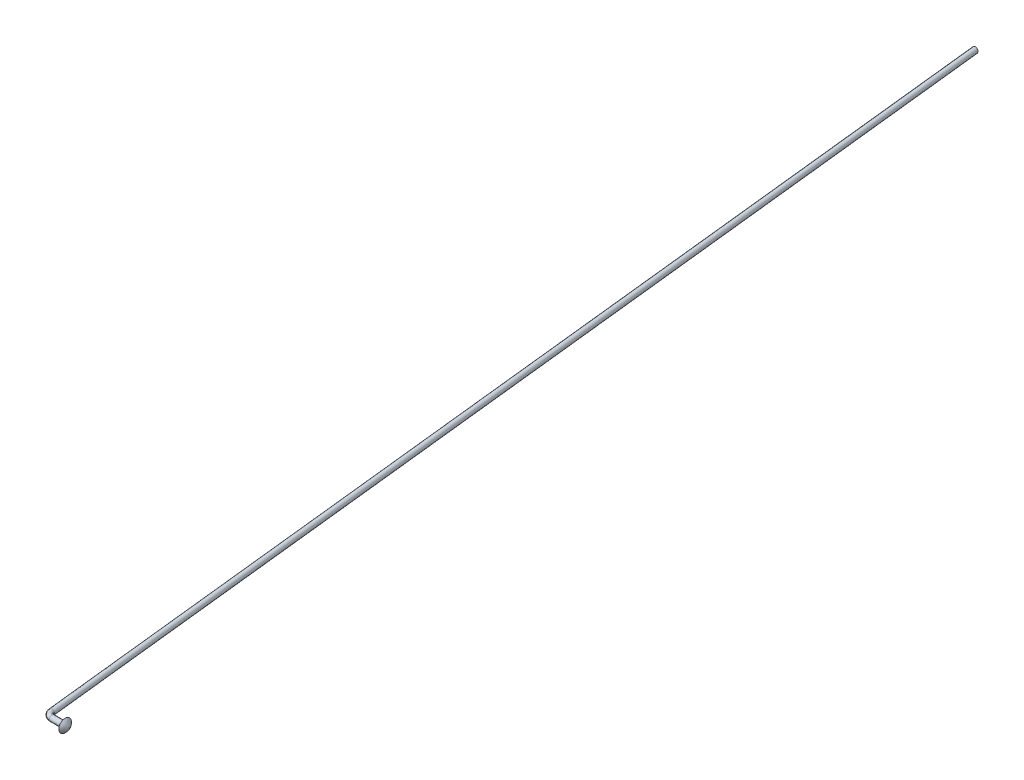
ISO-10303-21;
HEADER;
FILE_DESCRIPTION(('STEP AP214'),'2;1');
FILE_NAME('part.step','',(''),(''),'','','');
FILE_SCHEMA(('AUTOMOTIVE_DESIGN { 1 0 10303 214 1 1 1 1 }'));
ENDSEC;
DATA;
#1=APPLICATION_CONTEXT('core data for automotive mechanical design processes');
#2=APPLICATION_PROTOCOL_DEFINITION('international standard','automotive_design',2000,#1);
#3=PRODUCT_CONTEXT('',#1,'mechanical');
#4=PRODUCT('Part','Part','',(#3));
#5=PRODUCT_RELATED_PRODUCT_CATEGORY('part','',(#4));
#6=PRODUCT_DEFINITION_FORMATION('','',#4);
#7=PRODUCT_DEFINITION_CONTEXT('part definition',#1,'design');
#8=PRODUCT_DEFINITION('design','',#6,#7);
#9=PRODUCT_DEFINITION_SHAPE('','',#8);
#10=(LENGTH_UNIT() NAMED_UNIT(*) SI_UNIT(.MILLI.,.METRE.));
#11=(NAMED_UNIT(*) PLANE_ANGLE_UNIT() SI_UNIT($,.RADIAN.));
#12=(NAMED_UNIT(*) SI_UNIT($,.STERADIAN.) SOLID_ANGLE_UNIT());
#13=UNCERTAINTY_MEASURE_WITH_UNIT(LENGTH_MEASURE(1.E-05),#10,'distance_accuracy_value','');
#14=(GEOMETRIC_REPRESENTATION_CONTEXT(3) GLOBAL_UNCERTAINTY_ASSIGNED_CONTEXT((#13)) GLOBAL_UNIT_ASSIGNED_CONTEXT((#10,
#11,#12)) REPRESENTATION_CONTEXT('',''));
#15=CARTESIAN_POINT('',(0.,0.,0.));
#16=DIRECTION('',(0.,0.,1.));
#17=DIRECTION('',(1.,0.,0.));
#18=AXIS2_PLACEMENT_3D('',#15,#16,#17);
#19=CARTESIAN_POINT('',(0.758258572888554,6.66133814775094E-13,279.329081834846));
#20=DIRECTION('',(0.994746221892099,0.,0.102371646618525));
#21=DIRECTION('',(0.102371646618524,0.,-0.994746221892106));
#22=AXIS2_PLACEMENT_3D('',#19,#20,#21);
#23=CIRCLE('',#22,0.750000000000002);
#24=DIRECTION('',(0.999999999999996,0.,0.));
#25=VECTOR('',#24,1.);
#26=SURFACE_OF_LINEAR_EXTRUSION('',#23,#25);
#27=CARTESIAN_POINT('',(0.835037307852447,6.65426047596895E-13,278.583022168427));
#28=VERTEX_POINT('',#27);
#29=EDGE_CURVE('E73',#28,#28,#23,.T.);
#30=ORIENTED_EDGE('',*,*,#29,.T.);
#31=EDGE_LOOP('',(#30));
#32=FACE_BOUND('',#31,.T.);
#33=CARTESIAN_POINT('',(4.22781762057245,1.11022302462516E-12,279.329081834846));
#34=DIRECTION('',(0.994746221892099,0.,0.102371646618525));
#35=DIRECTION('',(0.102371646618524,0.,-0.994746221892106));
#36=AXIS2_PLACEMENT_3D('',#33,#34,#35);
#37=CIRCLE('',#36,0.750000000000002);
#38=CARTESIAN_POINT('',(4.22781762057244,0.75000000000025,279.329081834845));
#39=VERTEX_POINT('',#38);
#40=CARTESIAN_POINT('',(4.22781762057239,-0.750000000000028,279.329081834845));
#41=VERTEX_POINT('',#40);
#42=EDGE_CURVE('E39',#39,#41,#37,.T.);
#43=ORIENTED_EDGE('',*,*,#42,.F.);
#44=CARTESIAN_POINT('',(4.22781762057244,0.75000000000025,279.329081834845));
#45=CARTESIAN_POINT('',(4.2278176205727,0.750034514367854,279.287890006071));
#46=CARTESIAN_POINT('',(4.22781762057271,0.746572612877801,279.246709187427));
#47=CARTESIAN_POINT('',(4.2278176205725,0.732907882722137,279.165493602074));
#48=CARTESIAN_POINT('',(4.22781762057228,0.722707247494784,279.125458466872));
#49=CARTESIAN_POINT('',(4.22781762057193,0.695816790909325,279.047630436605));
#50=CARTESIAN_POINT('',(4.22781762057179,0.679127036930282,279.009837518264));
#51=CARTESIAN_POINT('',(4.22781762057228,0.639740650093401,278.937525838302));
#52=CARTESIAN_POINT('',(4.2278176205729,0.61704410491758,278.903007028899));
#53=CARTESIAN_POINT('',(4.22781762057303,0.566276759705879,278.838179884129));
#54=CARTESIAN_POINT('',(4.22781762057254,0.538206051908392,278.807871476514));
#55=CARTESIAN_POINT('',(4.22781762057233,0.47746913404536,278.752278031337));
#56=CARTESIAN_POINT('',(4.2278176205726,0.444803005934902,278.72699290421));
#57=CARTESIAN_POINT('',(4.22781762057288,0.375770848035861,278.682117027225));
#58=CARTESIAN_POINT('',(4.2278176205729,0.33940487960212,278.662526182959));
#59=CARTESIAN_POINT('',(4.2278176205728,0.263960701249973,278.629553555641));
#60=CARTESIAN_POINT('',(4.22781762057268,0.224882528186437,278.616171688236));
#61=CARTESIAN_POINT('',(4.22781762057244,0.145066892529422,278.59596575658));
#62=CARTESIAN_POINT('',(4.22781762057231,0.104329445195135,278.589141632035));
#63=CARTESIAN_POINT('',(4.22781762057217,0.0222873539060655,278.582228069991));
#64=CARTESIAN_POINT('',(4.22781762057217,-0.0190172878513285,278.582138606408));
#65=CARTESIAN_POINT('',(4.22781762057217,-0.101088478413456,278.588696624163));
#66=CARTESIAN_POINT('',(4.22781762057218,-0.1418550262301,278.59534411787));
#67=CARTESIAN_POINT('',(4.22781762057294,-0.22175729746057,278.615203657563));
#68=CARTESIAN_POINT('',(4.22781762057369,-0.260893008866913,278.628415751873));
#69=CARTESIAN_POINT('',(4.22781762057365,-0.336479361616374,278.66106016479));
#70=CARTESIAN_POINT('',(4.22781762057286,-0.372929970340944,278.680492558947));
#71=CARTESIAN_POINT('',(4.22781762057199,-0.442156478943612,278.725067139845));
#72=CARTESIAN_POINT('',(4.22781762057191,-0.474932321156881,278.750209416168));
#73=CARTESIAN_POINT('',(4.22781762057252,-0.535911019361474,278.805536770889));
#74=CARTESIAN_POINT('',(4.22781762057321,-0.564113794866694,278.835721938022));
#75=CARTESIAN_POINT('',(4.22781762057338,-0.615164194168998,278.900325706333));
#76=CARTESIAN_POINT('',(4.22781762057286,-0.638011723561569,278.934744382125));
#77=CARTESIAN_POINT('',(4.22781762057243,-0.67771503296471,279.006882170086));
#78=CARTESIAN_POINT('',(4.22781762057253,-0.694570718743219,279.044601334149));
#79=CARTESIAN_POINT('',(4.22781762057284,-0.72178829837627,279.122267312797));
#80=CARTESIAN_POINT('',(4.22781762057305,-0.732157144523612,279.162211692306));
#81=CARTESIAN_POINT('',(4.22781762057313,-0.746380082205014,279.244436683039));
#82=CARTESIAN_POINT('',(4.22781762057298,-0.750036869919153,279.286751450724));
#83=CARTESIAN_POINT('',(4.22781762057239,-0.750000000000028,279.329081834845));
#84=B_SPLINE_CURVE_WITH_KNOTS('',3,(#44,#45,#46,#47,#48,#49,#50,#51,#52,#53,#54,#55,#56,#57,#58,
#59,#60,#61,#62,#63,#64,#65,#66,#67,#68,#69,#70,#71,#72,#73,#74,#75,#76,#77,#78,#79,#80,#81,#82,
#83),.UNSPECIFIED.,.F.,.F.,(4,2,2,2,2,2,2,2,2,2,2,2,2,2,2,2,2,2,2,4),(0.,0.123414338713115,
0.246788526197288,0.37016143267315,0.493532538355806,0.616901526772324,0.740268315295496,
0.863633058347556,0.986996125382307,1.11035805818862,1.23371951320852,1.35708119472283,
1.48044378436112,1.60380787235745,1.72717389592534,1.85054209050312,1.97391245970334,
2.09728476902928,2.22052462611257,2.34733247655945),.UNSPECIFIED.);
#85=EDGE_CURVE('E45',#39,#41,#84,.T.);
#86=ORIENTED_EDGE('',*,*,#85,.T.);
#87=EDGE_LOOP('',(#43,#86));
#88=FACE_BOUND('',#87,.T.);
#89=ADVANCED_FACE('F30',(#32,#88),#26,.T.);
#90=CARTESIAN_POINT('',(4.22781762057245,1.11022302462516E-12,279.329081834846));
#91=DIRECTION('',(0.994746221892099,0.,0.102371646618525));
#92=DIRECTION('',(0.102371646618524,0.,-0.994746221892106));
#93=AXIS2_PLACEMENT_3D('',#90,#91,#92);
#94=PLANE('',#93);
#95=ORIENTED_EDGE('',*,*,#42,.T.);
#96=DIRECTION('',(0.,1.00000000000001,0.));
#97=VECTOR('',#96,1.);
#98=CARTESIAN_POINT('',(4.22781762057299,6.66133814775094E-13,279.329081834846));
#99=LINE('',#98,#97);
#100=EDGE_CURVE('E11',#41,#39,#99,.T.);
#101=ORIENTED_EDGE('',*,*,#100,.T.);
#102=EDGE_LOOP('',(#95,#101));
#103=FACE_BOUND('',#102,.T.);
#104=ADVANCED_FACE('F62',(#103),#94,.T.);
#105=CARTESIAN_POINT('',(-0.733860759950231,2.22044604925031E-13,277.982639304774));
#106=DIRECTION('',(0.,0.,1.));
#107=DIRECTION('',(0.999999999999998,0.,0.));
#108=AXIS2_PLACEMENT_3D('',#105,#106,#107);
#109=CIRCLE('',#108,0.750000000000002);
#110=CARTESIAN_POINT('',(0.758258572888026,6.66133814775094E-13,277.829081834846));
#111=DIRECTION('',(0.,1.00000000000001,0.));
#112=AXIS1_PLACEMENT('',#110,#111);
#113=SURFACE_OF_REVOLUTION('',#109,#112);
#114=CARTESIAN_POINT('',(0.0161392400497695,2.22013379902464E-13,277.982639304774));
#115=VERTEX_POINT('',#114);
#116=EDGE_CURVE('E76',#115,#115,#109,.T.);
#117=ORIENTED_EDGE('',*,*,#116,.T.);
#118=EDGE_LOOP('',(#117));
#119=FACE_BOUND('',#118,.T.);
#120=ORIENTED_EDGE('',*,*,#29,.F.);
#121=EDGE_LOOP('',(#120));
#122=FACE_BOUND('',#121,.T.);
#123=ADVANCED_FACE('F67',(#119,#122),#113,.F.);
#124=DIRECTION('',(-0.107177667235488,0.,-0.994239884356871));
#125=VECTOR('',#124,1.);
#126=SURFACE_OF_LINEAR_EXTRUSION('',#109,#125);
#127=ORIENTED_EDGE('',*,*,#116,.F.);
#128=EDGE_LOOP('',(#127));
#129=FACE_BOUND('',#128,.T.);
#130=CARTESIAN_POINT('',(-30.7000000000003,4.44089209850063E-13,1.33226762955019E-12));
#131=DIRECTION('',(0.,0.,1.));
#132=DIRECTION('',(0.999999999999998,0.,0.));
#133=AXIS2_PLACEMENT_3D('',#130,#131,#132);
#134=CIRCLE('',#133,0.750000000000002);
#135=CARTESIAN_POINT('',(-29.9500000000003,4.44057984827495E-13,1.33225852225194E-12));
#136=VERTEX_POINT('',#135);
#137=EDGE_CURVE('E79',#136,#136,#134,.T.);
#138=ORIENTED_EDGE('',*,*,#137,.T.);
#139=EDGE_LOOP('',(#138));
#140=FACE_BOUND('',#139,.T.);
#141=ADVANCED_FACE('F92',(#129,#140),#126,.F.);
#142=CARTESIAN_POINT('',(-30.7000000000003,4.44089209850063E-13,1.33226762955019E-12));
#143=DIRECTION('',(0.,0.,1.));
#144=DIRECTION('',(0.999999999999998,0.,0.));
#145=AXIS2_PLACEMENT_3D('',#142,#143,#144);
#146=PLANE('',#145);
#147=ORIENTED_EDGE('',*,*,#137,.F.);
#148=EDGE_LOOP('',(#147));
#149=FACE_BOUND('',#148,.T.);
#150=ADVANCED_FACE('F58',(#149),#146,.F.);
#151=CARTESIAN_POINT('',(4.22781762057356,4.44089209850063E-13,279.329081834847));
#152=DIRECTION('',(0.999999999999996,0.,-1.11030976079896E-13));
#153=DIRECTION('',(-1.11034445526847E-13,0.,-1.));
#154=AXIS2_PLACEMENT_3D('',#151,#152,#153);
#155=PLANE('',#154);
#156=ORIENTED_EDGE('',*,*,#85,.F.);
#157=ORIENTED_EDGE('',*,*,#100,.F.);
#158=EDGE_LOOP('',(#156,#157));
#159=FACE_BOUND('',#158,.T.);
#160=CARTESIAN_POINT('',(4.22781762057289,8.88178419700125E-13,279.329081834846));
#161=DIRECTION('',(-0.999999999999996,0.,1.11030976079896E-13));
#162=DIRECTION('',(1.11034445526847E-13,0.,1.));
#163=AXIS2_PLACEMENT_3D('',#160,#161,#162);
#164=CIRCLE('',#163,1.69999999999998);
#165=CARTESIAN_POINT('',(4.22781762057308,8.90160167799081E-13,281.029081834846));
#166=VERTEX_POINT('',#165);
#167=EDGE_CURVE('E129',#166,#166,#164,.T.);
#168=ORIENTED_EDGE('',*,*,#167,.T.);
#169=EDGE_LOOP('',(#168));
#170=FACE_BOUND('',#169,.T.);
#171=ADVANCED_FACE('F52',(#159,#170),#155,.F.);
#172=CARTESIAN_POINT('',(2.28571292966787,8.87494679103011E-13,278.742549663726));
#173=DIRECTION('',(0.,-1.,0.));
#174=DIRECTION('',(1.11034445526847E-13,0.,1.));
#175=AXIS2_PLACEMENT_3D('',#172,#173,#174);
#176=CIRCLE('',#175,3.00000000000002);
#177=TRIMMED_CURVE('',#176,(PARAMETER_VALUE(-1.37401812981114)),
(PARAMETER_VALUE(1.37401812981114)),.T.,.PARAMETER.);
#178=CARTESIAN_POINT('',(2.28571292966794,8.88178419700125E-13,279.329081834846));
#179=DIRECTION('',(-0.999999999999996,0.,1.11030976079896E-13));
#180=AXIS1_PLACEMENT('',#178,#179);
#181=SURFACE_OF_REVOLUTION('',#177,#180);
#182=ORIENTED_EDGE('',*,*,#167,.F.);
#183=EDGE_LOOP('',(#182));
#184=FACE_BOUND('',#183,.T.);
#185=CARTESIAN_POINT('',(5.22781762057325,8.88178419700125E-13,279.329081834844));
#186=VERTEX_POINT('',#185);
#187=VERTEX_LOOP('',#186);
#188=FACE_BOUND('',#187,.T.);
#189=ADVANCED_FACE('F50',(#184,#188),#181,.T.);
#190=CLOSED_SHELL('',(#89,#104,#123,#141,#150,#171,#189));
#191=MANIFOLD_SOLID_BREP('B2',#190);
#192=ADVANCED_BREP_SHAPE_REPRESENTATION('',(#18,#191),#14);
#193=SHAPE_DEFINITION_REPRESENTATION(#9,#192);
ENDSEC;
END-ISO-10303-21;
